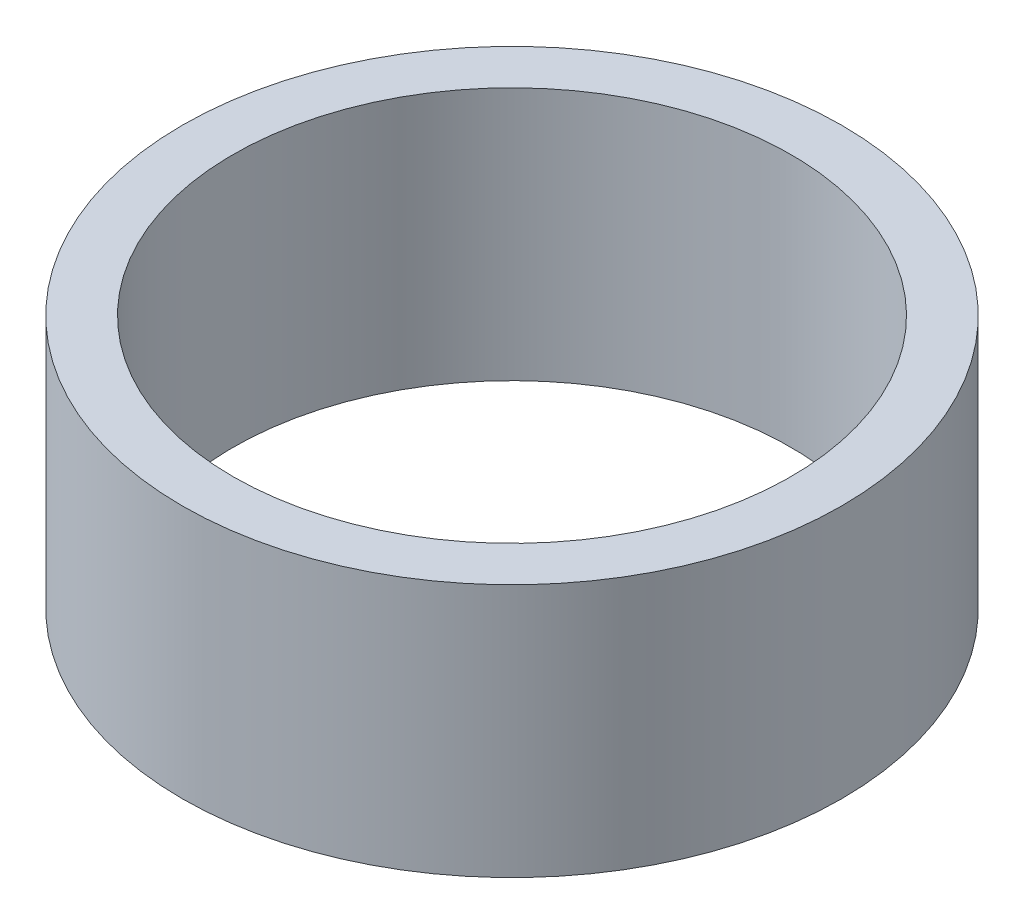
ISO-10303-21;
HEADER;
FILE_DESCRIPTION(('STEP AP214'),'2;1');
FILE_NAME('part.step','',(''),(''),'','','');
FILE_SCHEMA(('AUTOMOTIVE_DESIGN { 1 0 10303 214 1 1 1 1 }'));
ENDSEC;
DATA;
#1=APPLICATION_CONTEXT('core data for automotive mechanical design processes');
#2=APPLICATION_PROTOCOL_DEFINITION('international standard','automotive_design',2000,#1);
#3=PRODUCT_CONTEXT('',#1,'mechanical');
#4=PRODUCT('Part','Part','',(#3));
#5=PRODUCT_RELATED_PRODUCT_CATEGORY('part','',(#4));
#6=PRODUCT_DEFINITION_FORMATION('','',#4);
#7=PRODUCT_DEFINITION_CONTEXT('part definition',#1,'design');
#8=PRODUCT_DEFINITION('design','',#6,#7);
#9=PRODUCT_DEFINITION_SHAPE('','',#8);
#10=(LENGTH_UNIT() NAMED_UNIT(*) SI_UNIT(.MILLI.,.METRE.));
#11=(NAMED_UNIT(*) PLANE_ANGLE_UNIT() SI_UNIT($,.RADIAN.));
#12=(NAMED_UNIT(*) SI_UNIT($,.STERADIAN.) SOLID_ANGLE_UNIT());
#13=UNCERTAINTY_MEASURE_WITH_UNIT(LENGTH_MEASURE(1.E-05),#10,'distance_accuracy_value','');
#14=(GEOMETRIC_REPRESENTATION_CONTEXT(3) GLOBAL_UNCERTAINTY_ASSIGNED_CONTEXT((#13)) GLOBAL_UNIT_ASSIGNED_CONTEXT((#10,
#11,#12)) REPRESENTATION_CONTEXT('',''));
#15=CARTESIAN_POINT('',(0.,0.,0.));
#16=DIRECTION('',(0.,0.,1.));
#17=DIRECTION('',(1.,0.,0.));
#18=AXIS2_PLACEMENT_3D('',#15,#16,#17);
#19=CARTESIAN_POINT('',(0.,50.,0.));
#20=DIRECTION('',(0.,1.,0.));
#21=DIRECTION('',(0.,0.,1.));
#22=AXIS2_PLACEMENT_3D('',#19,#20,#21);
#23=PLANE('',#22);
#24=CARTESIAN_POINT('',(0.,50.,0.));
#25=DIRECTION('',(0.,1.,0.));
#26=DIRECTION('',(0.,0.,1.));
#27=AXIS2_PLACEMENT_3D('',#24,#25,#26);
#28=CIRCLE('',#27,65.);
#29=CARTESIAN_POINT('',(0.,50.,65.));
#30=VERTEX_POINT('',#29);
#31=EDGE_CURVE('E10',#30,#30,#28,.T.);
#32=ORIENTED_EDGE('',*,*,#31,.T.);
#33=EDGE_LOOP('',(#32));
#34=FACE_BOUND('',#33,.T.);
#35=CARTESIAN_POINT('',(0.,50.,0.));
#36=DIRECTION('',(0.,1.,0.));
#37=DIRECTION('',(0.,0.,1.));
#38=AXIS2_PLACEMENT_3D('',#35,#36,#37);
#39=CIRCLE('',#38,55.);
#40=CARTESIAN_POINT('',(0.,50.,55.));
#41=VERTEX_POINT('',#40);
#42=EDGE_CURVE('E48',#41,#41,#39,.T.);
#43=ORIENTED_EDGE('',*,*,#42,.F.);
#44=EDGE_LOOP('',(#43));
#45=FACE_BOUND('',#44,.T.);
#46=ADVANCED_FACE('F37',(#34,#45),#23,.T.);
#47=CARTESIAN_POINT('',(0.,0.,0.));
#48=DIRECTION('',(0.,1.,0.));
#49=DIRECTION('',(0.,0.,1.));
#50=AXIS2_PLACEMENT_3D('',#47,#48,#49);
#51=PLANE('',#50);
#52=CARTESIAN_POINT('',(0.,0.,0.));
#53=DIRECTION('',(0.,1.,0.));
#54=DIRECTION('',(0.,0.,1.));
#55=AXIS2_PLACEMENT_3D('',#52,#53,#54);
#56=CIRCLE('',#55,65.);
#57=CARTESIAN_POINT('',(0.,0.,65.));
#58=VERTEX_POINT('',#57);
#59=EDGE_CURVE('E41',#58,#58,#56,.T.);
#60=ORIENTED_EDGE('',*,*,#59,.F.);
#61=EDGE_LOOP('',(#60));
#62=FACE_BOUND('',#61,.T.);
#63=CARTESIAN_POINT('',(0.,0.,0.));
#64=DIRECTION('',(0.,1.,0.));
#65=DIRECTION('',(0.,0.,1.));
#66=AXIS2_PLACEMENT_3D('',#63,#64,#65);
#67=CIRCLE('',#66,55.);
#68=CARTESIAN_POINT('',(0.,0.,55.));
#69=VERTEX_POINT('',#68);
#70=EDGE_CURVE('E50',#69,#69,#67,.T.);
#71=ORIENTED_EDGE('',*,*,#70,.T.);
#72=EDGE_LOOP('',(#71));
#73=FACE_BOUND('',#72,.T.);
#74=ADVANCED_FACE('F60',(#62,#73),#51,.F.);
#75=CARTESIAN_POINT('',(0.,50.,0.));
#76=DIRECTION('',(0.,-1.,0.));
#77=DIRECTION('',(0.,0.,-1.));
#78=AXIS2_PLACEMENT_3D('',#75,#76,#77);
#79=CYLINDRICAL_SURFACE('',#78,65.);
#80=ORIENTED_EDGE('',*,*,#31,.F.);
#81=EDGE_LOOP('',(#80));
#82=FACE_BOUND('',#81,.T.);
#83=ORIENTED_EDGE('',*,*,#59,.T.);
#84=EDGE_LOOP('',(#83));
#85=FACE_BOUND('',#84,.T.);
#86=ADVANCED_FACE('F39',(#82,#85),#79,.T.);
#87=CARTESIAN_POINT('',(0.,50.,0.));
#88=DIRECTION('',(0.,-1.,0.));
#89=DIRECTION('',(0.,0.,-1.));
#90=AXIS2_PLACEMENT_3D('',#87,#88,#89);
#91=CYLINDRICAL_SURFACE('',#90,55.);
#92=ORIENTED_EDGE('',*,*,#42,.T.);
#93=EDGE_LOOP('',(#92));
#94=FACE_BOUND('',#93,.T.);
#95=ORIENTED_EDGE('',*,*,#70,.F.);
#96=EDGE_LOOP('',(#95));
#97=FACE_BOUND('',#96,.T.);
#98=ADVANCED_FACE('F56',(#94,#97),#91,.F.);
#99=CLOSED_SHELL('',(#46,#74,#86,#98));
#100=MANIFOLD_SOLID_BREP('B2',#99);
#101=ADVANCED_BREP_SHAPE_REPRESENTATION('',(#18,#100),#14);
#102=SHAPE_DEFINITION_REPRESENTATION(#9,#101);
ENDSEC;
END-ISO-10303-21;
